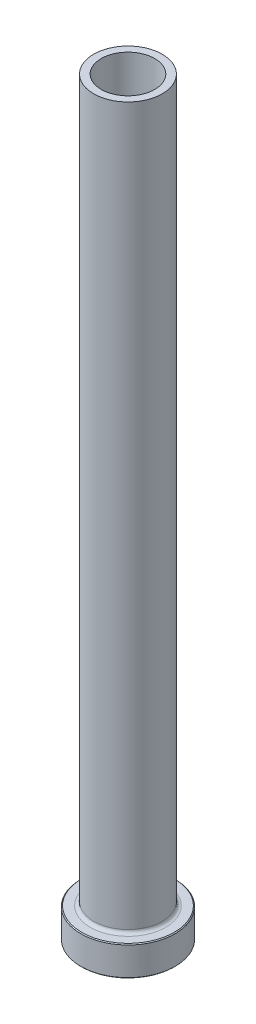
ISO-10303-21;
HEADER;
FILE_DESCRIPTION(('STEP AP214'),'2;1');
FILE_NAME('part.step','',(''),(''),'','','');
FILE_SCHEMA(('AUTOMOTIVE_DESIGN { 1 0 10303 214 1 1 1 1 }'));
ENDSEC;
DATA;
#1=APPLICATION_CONTEXT('core data for automotive mechanical design processes');
#2=APPLICATION_PROTOCOL_DEFINITION('international standard','automotive_design',2000,#1);
#3=PRODUCT_CONTEXT('',#1,'mechanical');
#4=PRODUCT('Part','Part','',(#3));
#5=PRODUCT_RELATED_PRODUCT_CATEGORY('part','',(#4));
#6=PRODUCT_DEFINITION_FORMATION('','',#4);
#7=PRODUCT_DEFINITION_CONTEXT('part definition',#1,'design');
#8=PRODUCT_DEFINITION('design','',#6,#7);
#9=PRODUCT_DEFINITION_SHAPE('','',#8);
#10=(LENGTH_UNIT() NAMED_UNIT(*) SI_UNIT(.MILLI.,.METRE.));
#11=(NAMED_UNIT(*) PLANE_ANGLE_UNIT() SI_UNIT($,.RADIAN.));
#12=(NAMED_UNIT(*) SI_UNIT($,.STERADIAN.) SOLID_ANGLE_UNIT());
#13=UNCERTAINTY_MEASURE_WITH_UNIT(LENGTH_MEASURE(1.E-05),#10,'distance_accuracy_value','');
#14=(GEOMETRIC_REPRESENTATION_CONTEXT(3) GLOBAL_UNCERTAINTY_ASSIGNED_CONTEXT((#13)) GLOBAL_UNIT_ASSIGNED_CONTEXT((#10,
#11,#12)) REPRESENTATION_CONTEXT('',''));
#15=CARTESIAN_POINT('',(0.,0.,0.));
#16=DIRECTION('',(0.,0.,1.));
#17=DIRECTION('',(1.,0.,0.));
#18=AXIS2_PLACEMENT_3D('',#15,#16,#17);
#19=CARTESIAN_POINT('',(0.,92.1876809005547,0.));
#20=DIRECTION('',(0.,1.,0.));
#21=DIRECTION('',(0.,0.,1.));
#22=AXIS2_PLACEMENT_3D('',#19,#20,#21);
#23=CYLINDRICAL_SURFACE('',#22,6.25);
#24=CARTESIAN_POINT('',(0.,175.,0.));
#25=DIRECTION('',(0.,1.,0.));
#26=DIRECTION('',(0.,0.,1.));
#27=AXIS2_PLACEMENT_3D('',#24,#25,#26);
#28=CIRCLE('',#27,6.25);
#29=CARTESIAN_POINT('',(0.,175.,6.25));
#30=VERTEX_POINT('',#29);
#31=EDGE_CURVE('E62',#30,#30,#28,.T.);
#32=ORIENTED_EDGE('',*,*,#31,.T.);
#33=EDGE_LOOP('',(#32));
#34=FACE_BOUND('',#33,.T.);
#35=CARTESIAN_POINT('',(0.,120.,0.));
#36=DIRECTION('',(0.,1.,0.));
#37=DIRECTION('',(0.,0.,1.));
#38=AXIS2_PLACEMENT_3D('',#35,#36,#37);
#39=CIRCLE('',#38,6.25);
#40=CARTESIAN_POINT('',(0.,120.,6.25));
#41=VERTEX_POINT('',#40);
#42=EDGE_CURVE('E71',#41,#41,#39,.T.);
#43=ORIENTED_EDGE('',*,*,#42,.F.);
#44=EDGE_LOOP('',(#43));
#45=FACE_BOUND('',#44,.T.);
#46=ADVANCED_FACE('F30',(#34,#45),#23,.F.);
#47=CARTESIAN_POINT('',(-6.25,175.,0.));
#48=DIRECTION('',(0.,1.,0.));
#49=DIRECTION('',(0.,0.,1.));
#50=AXIS2_PLACEMENT_3D('',#47,#48,#49);
#51=PLANE('',#50);
#52=CARTESIAN_POINT('',(0.,175.,0.));
#53=DIRECTION('',(0.,1.,0.));
#54=DIRECTION('',(0.,0.,1.));
#55=AXIS2_PLACEMENT_3D('',#52,#53,#54);
#56=CIRCLE('',#55,8.00000000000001);
#57=CARTESIAN_POINT('',(0.,175.,8.00000000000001));
#58=VERTEX_POINT('',#57);
#59=EDGE_CURVE('E65',#58,#58,#56,.T.);
#60=ORIENTED_EDGE('',*,*,#59,.T.);
#61=EDGE_LOOP('',(#60));
#62=FACE_BOUND('',#61,.T.);
#63=ORIENTED_EDGE('',*,*,#31,.F.);
#64=EDGE_LOOP('',(#63));
#65=FACE_BOUND('',#64,.T.);
#66=ADVANCED_FACE('F79',(#62,#65),#51,.T.);
#67=CARTESIAN_POINT('',(0.,92.1876809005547,0.));
#68=DIRECTION('',(0.,1.,0.));
#69=DIRECTION('',(0.,0.,1.));
#70=AXIS2_PLACEMENT_3D('',#67,#68,#69);
#71=CYLINDRICAL_SURFACE('',#70,8.);
#72=CARTESIAN_POINT('',(0.,7.8,0.));
#73=DIRECTION('',(0.,1.,0.));
#74=DIRECTION('',(0.,0.,1.));
#75=AXIS2_PLACEMENT_3D('',#72,#73,#74);
#76=CIRCLE('',#75,8.);
#77=CARTESIAN_POINT('',(0.,7.8,8.));
#78=VERTEX_POINT('',#77);
#79=EDGE_CURVE('E59',#78,#78,#76,.T.);
#80=ORIENTED_EDGE('',*,*,#79,.T.);
#81=EDGE_LOOP('',(#80));
#82=FACE_BOUND('',#81,.T.);
#83=ORIENTED_EDGE('',*,*,#59,.F.);
#84=EDGE_LOOP('',(#83));
#85=FACE_BOUND('',#84,.T.);
#86=ADVANCED_FACE('F85',(#82,#85),#71,.T.);
#87=CARTESIAN_POINT('',(-7.99999999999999,7.,0.));
#88=DIRECTION('',(0.,1.,0.));
#89=DIRECTION('',(0.,0.,1.));
#90=AXIS2_PLACEMENT_3D('',#87,#88,#89);
#91=PLANE('',#90);
#92=CARTESIAN_POINT('',(0.,7.,0.));
#93=DIRECTION('',(0.,1.,0.));
#94=DIRECTION('',(0.,0.,1.));
#95=AXIS2_PLACEMENT_3D('',#92,#93,#94);
#96=CIRCLE('',#95,10.8);
#97=CARTESIAN_POINT('',(0.,7.,10.8));
#98=VERTEX_POINT('',#97);
#99=EDGE_CURVE('E53',#98,#98,#96,.T.);
#100=ORIENTED_EDGE('',*,*,#99,.T.);
#101=EDGE_LOOP('',(#100));
#102=FACE_BOUND('',#101,.T.);
#103=CARTESIAN_POINT('',(0.,7.,0.));
#104=DIRECTION('',(0.,1.,0.));
#105=DIRECTION('',(0.,0.,1.));
#106=AXIS2_PLACEMENT_3D('',#103,#104,#105);
#107=CIRCLE('',#106,8.8);
#108=CARTESIAN_POINT('',(0.,7.,8.8));
#109=VERTEX_POINT('',#108);
#110=EDGE_CURVE('E56',#109,#109,#107,.F.);
#111=ORIENTED_EDGE('',*,*,#110,.T.);
#112=EDGE_LOOP('',(#111));
#113=FACE_BOUND('',#112,.T.);
#114=ADVANCED_FACE('F111',(#102,#113),#91,.T.);
#115=CARTESIAN_POINT('',(0.,92.1876809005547,0.));
#116=DIRECTION('',(0.,1.,0.));
#117=DIRECTION('',(0.,0.,1.));
#118=AXIS2_PLACEMENT_3D('',#115,#116,#117);
#119=CYLINDRICAL_SURFACE('',#118,11.);
#120=CARTESIAN_POINT('',(0.,6.8,0.));
#121=DIRECTION('',(0.,1.,0.));
#122=DIRECTION('',(0.,0.,1.));
#123=AXIS2_PLACEMENT_3D('',#120,#121,#122);
#124=CIRCLE('',#123,11.);
#125=CARTESIAN_POINT('',(0.,6.8,11.));
#126=VERTEX_POINT('',#125);
#127=EDGE_CURVE('E45',#126,#126,#124,.F.);
#128=ORIENTED_EDGE('',*,*,#127,.T.);
#129=EDGE_LOOP('',(#128));
#130=FACE_BOUND('',#129,.T.);
#131=CARTESIAN_POINT('',(0.,0.199999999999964,0.));
#132=DIRECTION('',(0.,-1.,0.));
#133=DIRECTION('',(0.,0.,-1.));
#134=AXIS2_PLACEMENT_3D('',#131,#132,#133);
#135=CIRCLE('',#134,11.);
#136=CARTESIAN_POINT('',(0.,0.199999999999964,-11.));
#137=VERTEX_POINT('',#136);
#138=EDGE_CURVE('E50',#137,#137,#135,.F.);
#139=ORIENTED_EDGE('',*,*,#138,.T.);
#140=EDGE_LOOP('',(#139));
#141=FACE_BOUND('',#140,.T.);
#142=ADVANCED_FACE('F108',(#130,#141),#119,.T.);
#143=CARTESIAN_POINT('',(-11.,0.,0.));
#144=DIRECTION('',(0.,-1.,0.));
#145=DIRECTION('',(0.,0.,-1.));
#146=AXIS2_PLACEMENT_3D('',#143,#144,#145);
#147=PLANE('',#146);
#148=CARTESIAN_POINT('',(0.,0.,0.));
#149=DIRECTION('',(0.,-1.,0.));
#150=DIRECTION('',(0.,0.,-1.));
#151=AXIS2_PLACEMENT_3D('',#148,#149,#150);
#152=CIRCLE('',#151,6.99999999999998);
#153=CARTESIAN_POINT('',(0.,0.,-6.99999999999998));
#154=VERTEX_POINT('',#153);
#155=EDGE_CURVE('E37',#154,#154,#152,.F.);
#156=ORIENTED_EDGE('',*,*,#155,.T.);
#157=EDGE_LOOP('',(#156));
#158=FACE_BOUND('',#157,.T.);
#159=CARTESIAN_POINT('',(0.,0.,0.));
#160=DIRECTION('',(0.,-1.,0.));
#161=DIRECTION('',(0.,0.,-1.));
#162=AXIS2_PLACEMENT_3D('',#159,#160,#161);
#163=CIRCLE('',#162,10.8);
#164=CARTESIAN_POINT('',(0.,0.,-10.8));
#165=VERTEX_POINT('',#164);
#166=EDGE_CURVE('E41',#165,#165,#163,.T.);
#167=ORIENTED_EDGE('',*,*,#166,.T.);
#168=EDGE_LOOP('',(#167));
#169=FACE_BOUND('',#168,.T.);
#170=ADVANCED_FACE('F110',(#158,#169),#147,.T.);
#171=CARTESIAN_POINT('',(0.,92.1876809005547,0.));
#172=DIRECTION('',(0.,1.,0.));
#173=DIRECTION('',(0.,0.,1.));
#174=AXIS2_PLACEMENT_3D('',#171,#172,#173);
#175=CYLINDRICAL_SURFACE('',#174,6.5);
#176=CARTESIAN_POINT('',(0.,0.499999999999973,0.));
#177=DIRECTION('',(0.,-1.,0.));
#178=DIRECTION('',(0.,0.,-1.));
#179=AXIS2_PLACEMENT_3D('',#176,#177,#178);
#180=CIRCLE('',#179,6.5);
#181=CARTESIAN_POINT('',(0.,0.499999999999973,-6.5));
#182=VERTEX_POINT('',#181);
#183=EDGE_CURVE('E10',#182,#182,#180,.T.);
#184=ORIENTED_EDGE('',*,*,#183,.T.);
#185=EDGE_LOOP('',(#184));
#186=FACE_BOUND('',#185,.T.);
#187=CARTESIAN_POINT('',(0.,108.,0.));
#188=DIRECTION('',(0.,1.,0.));
#189=DIRECTION('',(0.,0.,1.));
#190=AXIS2_PLACEMENT_3D('',#187,#188,#189);
#191=CIRCLE('',#190,6.5);
#192=CARTESIAN_POINT('',(0.,108.,6.5));
#193=VERTEX_POINT('',#192);
#194=EDGE_CURVE('E68',#193,#193,#191,.T.);
#195=ORIENTED_EDGE('',*,*,#194,.T.);
#196=EDGE_LOOP('',(#195));
#197=FACE_BOUND('',#196,.T.);
#198=ADVANCED_FACE('F118',(#186,#197),#175,.F.);
#199=CARTESIAN_POINT('',(0.,108.,0.));
#200=DIRECTION('',(0.,-1.,0.));
#201=DIRECTION('',(0.,0.,-1.));
#202=AXIS2_PLACEMENT_3D('',#199,#200,#201);
#203=CONICAL_SURFACE('',#202,6.5,0.0208303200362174);
#204=ORIENTED_EDGE('',*,*,#42,.T.);
#205=EDGE_LOOP('',(#204));
#206=FACE_BOUND('',#205,.T.);
#207=ORIENTED_EDGE('',*,*,#194,.F.);
#208=EDGE_LOOP('',(#207));
#209=FACE_BOUND('',#208,.T.);
#210=ADVANCED_FACE('F75',(#206,#209),#203,.F.);
#211=CARTESIAN_POINT('',(0.,7.8,0.));
#212=DIRECTION('',(0.,1.,0.));
#213=DIRECTION('',(0.,0.,1.));
#214=AXIS2_PLACEMENT_3D('',#211,#212,#213);
#215=TOROIDAL_SURFACE('',#214,8.8,0.8);
#216=ORIENTED_EDGE('',*,*,#110,.F.);
#217=EDGE_LOOP('',(#216));
#218=FACE_BOUND('',#217,.T.);
#219=ORIENTED_EDGE('',*,*,#79,.F.);
#220=EDGE_LOOP('',(#219));
#221=FACE_BOUND('',#220,.T.);
#222=ADVANCED_FACE('F90',(#218,#221),#215,.F.);
#223=CARTESIAN_POINT('',(0.,7.00000000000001,0.));
#224=DIRECTION('',(0.,-1.,0.));
#225=DIRECTION('',(0.,0.,-1.));
#226=AXIS2_PLACEMENT_3D('',#223,#224,#225);
#227=CONICAL_SURFACE('',#226,10.8,0.785398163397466);
#228=ORIENTED_EDGE('',*,*,#127,.F.);
#229=EDGE_LOOP('',(#228));
#230=FACE_BOUND('',#229,.T.);
#231=ORIENTED_EDGE('',*,*,#99,.F.);
#232=EDGE_LOOP('',(#231));
#233=FACE_BOUND('',#232,.T.);
#234=ADVANCED_FACE('F93',(#230,#233),#227,.T.);
#235=CARTESIAN_POINT('',(0.,0.199999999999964,0.));
#236=DIRECTION('',(0.,1.,0.));
#237=DIRECTION('',(0.,0.,1.));
#238=AXIS2_PLACEMENT_3D('',#235,#236,#237);
#239=CONICAL_SURFACE('',#238,11.,0.785398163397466);
#240=ORIENTED_EDGE('',*,*,#166,.F.);
#241=EDGE_LOOP('',(#240));
#242=FACE_BOUND('',#241,.T.);
#243=ORIENTED_EDGE('',*,*,#138,.F.);
#244=EDGE_LOOP('',(#243));
#245=FACE_BOUND('',#244,.T.);
#246=ADVANCED_FACE('F96',(#242,#245),#239,.T.);
#247=CARTESIAN_POINT('',(0.,0.,0.));
#248=DIRECTION('',(0.,-1.,0.));
#249=DIRECTION('',(0.,0.,-1.));
#250=AXIS2_PLACEMENT_3D('',#247,#248,#249);
#251=CONICAL_SURFACE('',#250,6.99999999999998,0.785398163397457);
#252=ORIENTED_EDGE('',*,*,#183,.F.);
#253=EDGE_LOOP('',(#252));
#254=FACE_BOUND('',#253,.T.);
#255=ORIENTED_EDGE('',*,*,#155,.F.);
#256=EDGE_LOOP('',(#255));
#257=FACE_BOUND('',#256,.T.);
#258=ADVANCED_FACE('F32',(#254,#257),#251,.F.);
#259=CLOSED_SHELL('',(#46,#66,#86,#114,#142,#170,#198,#210,#222,#234,#246,#258));
#260=MANIFOLD_SOLID_BREP('B2',#259);
#261=ADVANCED_BREP_SHAPE_REPRESENTATION('',(#18,#260),#14);
#262=SHAPE_DEFINITION_REPRESENTATION(#9,#261);
ENDSEC;
END-ISO-10303-21;
